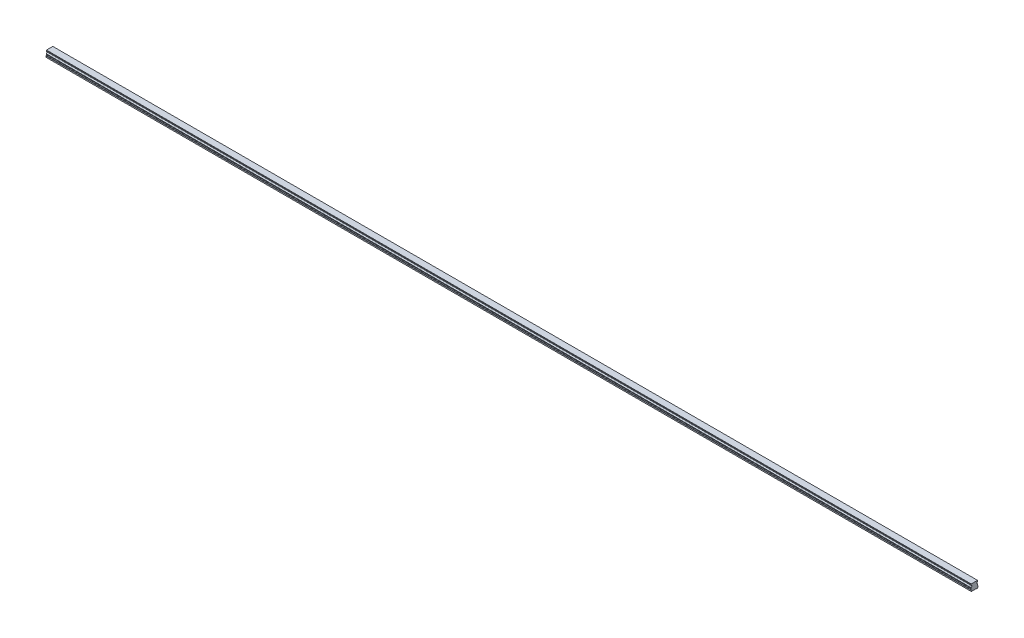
from build123d import *

# Parameters (mm, degrees)
BOSS_EXTRUDE1_DEPTH        = 1920
SKETCH3_R                  = 2.5
SKETCH3_R_2                = 2.1
CUT_EXTRUDE3_DEPTH         = 7
SKETCH3_2_R                = 2.1
CUT_EXTRUDE4_DEPTH         = 9.5
CHAMFER1_SIZE              = 0.4
LPATTERN2_COUNT            = 32
LPATTERN2_PITCH            = 60
CHAMFER1_OF_LPATTERN2_SIZE = 0.4


with BuildPart() as part:
    # Sketch1 → Boss-Extrude1 (new body)
    with BuildSketch(Plane(origin=(0, 0, 0), x_dir=(0, 0, -1), z_dir=(1, 0, 0))):
        with BuildLine():
            Line((6.59, 14), (-6.59, 14))
            Line((-6.59, 14), (-6.59, 13.15))
            Line((-6.59, 13.15), (-6.96, 12.356532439))
            Line((-6.96, 12.356532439), (-6.96, 11.435174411))
            ThreePointArc((-6.96, 11.435174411), (-5.25, 9.5), (-6.96, 7.564825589))
            Line((-6.96, 7.564825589), (-6.96, 6.643467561))
            Line((-6.96, 6.643467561), (-6.59, 5.85))
            Line((-6.59, 5.85), (-7.032116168, 4.2))
            Line((-7.032116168, 4.2), (-7.5, 3.929867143))
            Line((-7.5, 3.929867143), (-7.5, 1.4))
            Line((-7.5, 1.4), (-6.1, 0))
            Line((-6.1, 0), (-3.65, 0))
            Line((-3.65, 0), (-3.25, 0.4))
            Line((-3.25, 0.4), (3.25, 0.4))
            Line((3.25, 0.4), (3.65, 0))
            Line((3.65, 0), (6.1, 0))
            Line((6.1, 0), (7.5, 1.4))
            Line((7.5, 1.4), (7.5, 3.929867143))
            Line((7.5, 3.929867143), (7.032116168, 4.2))
            Line((7.032116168, 4.2), (6.59, 5.85))
            Line((6.59, 5.85), (6.96, 6.643467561))
            Line((6.96, 6.643467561), (6.96, 7.564825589))
            ThreePointArc((6.96, 7.564825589), (5.25, 9.5), (6.96, 11.435174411))
            Line((6.96, 11.435174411), (6.96, 12.356532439))
            Line((6.96, 12.356532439), (6.59, 13.15))
            Line((6.59, 13.15), (6.59, 14))
        make_face()
    extrude(amount=BOSS_EXTRUDE1_DEPTH)

    # Sketch3 → Cut-Extrude3 (cut)
    with BuildSketch(Plane.XZ):
        with Locations(Location((30, 0, 0), (0, 0, 270))):
            Circle(SKETCH3_R)
        with Locations(Location((30, 0, 0), (0, 0, 270))):
            Circle(SKETCH3_R_2, mode=Mode.SUBTRACT)
    cut_extrude3 = extrude(amount=-CUT_EXTRUDE3_DEPTH, mode=Mode.SUBTRACT)

    # Sketch3_2 → Cut-Extrude4 (cut)
    with BuildSketch(Plane.XZ):
        with Locations(Location((30, 0, 0), (0, 0, 270))):
            Circle(SKETCH3_2_R)
    cut_extrude4 = extrude(amount=-CUT_EXTRUDE4_DEPTH, mode=Mode.SUBTRACT)

    # Cut-Extrude5 cone 1 section (on through the dimple's axis) → Cut-Extrude5 (revolve, cut)
    with BuildSketch(Plane(origin=(30, 9.5, 0), x_dir=(0, 0, -1), z_dir=(1, 0, 0))):
        Polygon((0, 0), (2.1, 0), (0, 1.212435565), align=None)
    revolve(axis=Axis((30, 9.5, 0), (0, 1, 0)), mode=Mode.SUBTRACT)

    # Chamfer1
    chamfer1_edges = [part.edges().sort_by_distance(p)[0] for p in [
        (30, 0.4, 2.5),
    ]]
    chamfer(chamfer1_edges, length=CHAMFER1_SIZE)

    # LPattern2: Cut-Extrude3, Cut-Extrude4 ×32
    with Locations(*[(i * LPATTERN2_PITCH, 0, 0) for i in range(1, LPATTERN2_COUNT)]):
        add(cut_extrude3, mode=Mode.SUBTRACT)
        add(cut_extrude4, mode=Mode.SUBTRACT)

    # Chamfer1 of LPattern2
    chamfer1_of_lpattern2_edges = [part.edges().sort_by_distance(p)[0] for p in [
        (90, 0.4, 2.5),
        (150, 0.4, 2.5),
        (210, 0.4, 2.5),
        (270, 0.4, 2.5),
        (330, 0.4, 2.5),
        (390, 0.4, 2.5),
        (450, 0.4, 2.5),
        (510, 0.4, 2.5),
        (570, 0.4, 2.5),
        (630, 0.4, 2.5),
        (690, 0.4, 2.5),
        (750, 0.4, 2.5),
        (810, 0.4, 2.5),
        (870, 0.4, 2.5),
        (930, 0.4, 2.5),
        (990, 0.4, 2.5),
        (1050, 0.4, 2.5),
        (1110, 0.4, 2.5),
        (1170, 0.4, 2.5),
        (1230, 0.4, 2.5),
        (1290, 0.4, 2.5),
        (1350, 0.4, 2.5),
        (1410, 0.4, 2.5),
        (1470, 0.4, 2.5),
        (1530, 0.4, 2.5),
        (1590, 0.4, 2.5),
        (1650, 0.4, 2.5),
        (1710, 0.4, 2.5),
        (1770, 0.4, 2.5),
        (1830, 0.4, 2.5),
        (1890, 0.4, 2.5),
    ]]
    chamfer(chamfer1_of_lpattern2_edges, length=CHAMFER1_OF_LPATTERN2_SIZE)


solid = part.part
